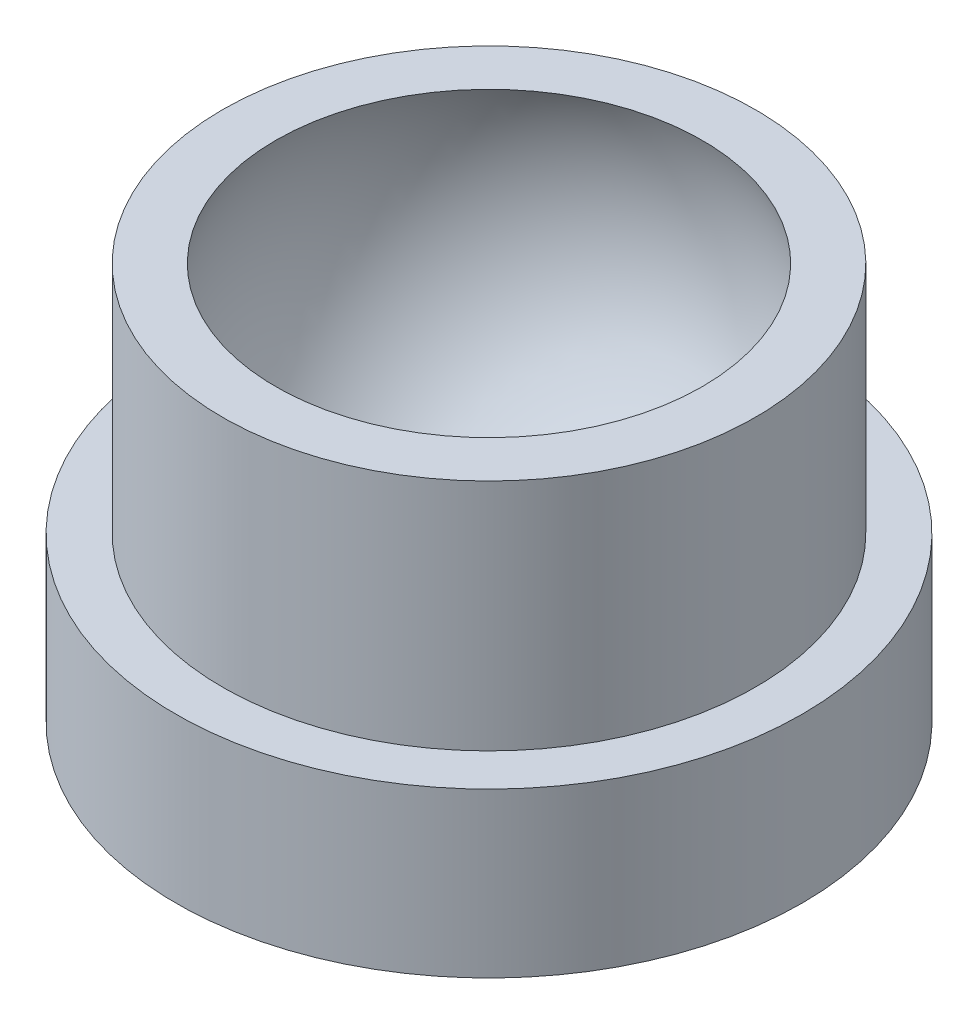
from build123d import *


with BuildPart() as part:
    # Sketch1 → Revolve1 (revolve)
    with BuildSketch(Plane.XY, mode=Mode.PRIVATE) as revolve1_sk:
        Polygon((17.018, 12.7), (17.018, -8.89), (34.036, -8.89), (34.036, 0), (31.496, 0), (31.496, 12.7), align=None)
    revolve(revolve1_sk.sketch.rotate(Axis((17.018, 12.7, 0), (0, -1, 0)), 180), axis=Axis((17.018, 12.7, 0), (0, -1, 0)))

    # Sketch2 → Cut-Revolve1 (revolve, cut)
    with BuildSketch(Plane.XY):
        with BuildLine():
            Line((4.318, 7.510807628), (29.718, 7.510807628))
            ThreePointArc((29.718, 7.510807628), (17.018, 20.210807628), (4.318, 7.510807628))
        make_face()
    revolve(axis=Axis((4.318, 7.510807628, 0), (1, 0, 0)), mode=Mode.SUBTRACT)


solid = part.part
